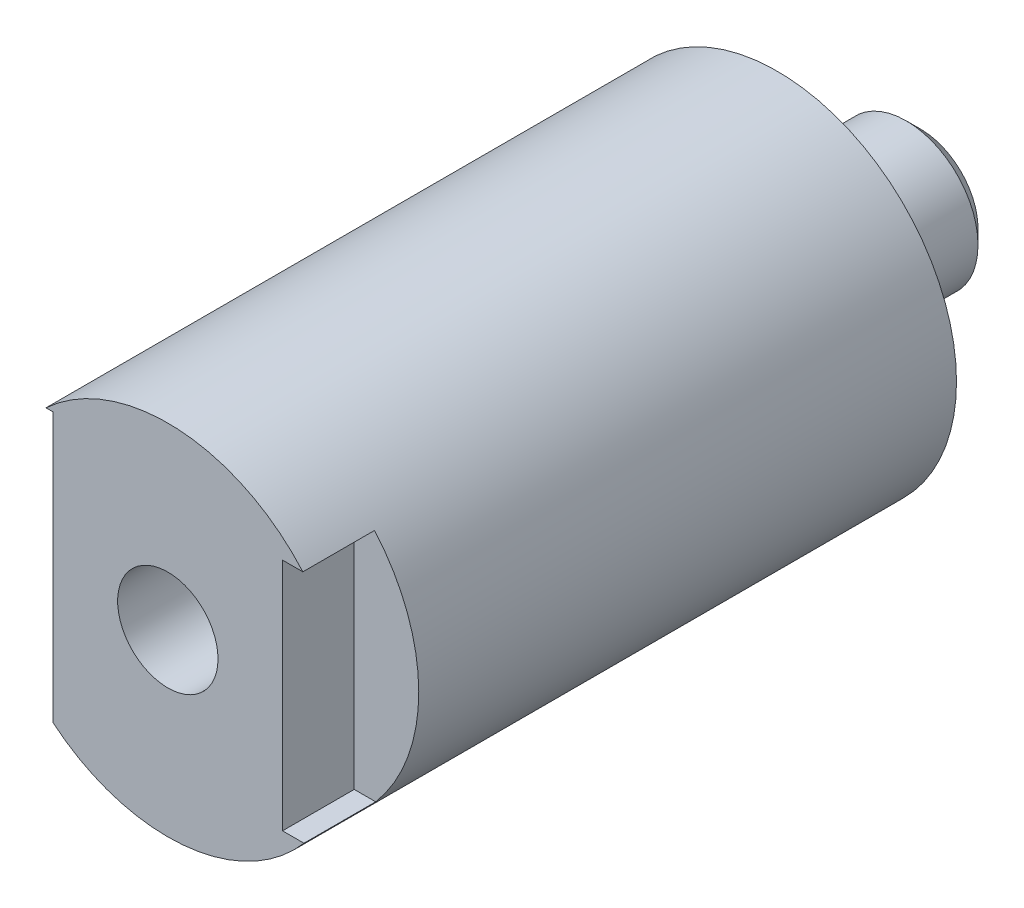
ISO-10303-21;
HEADER;
FILE_DESCRIPTION(('STEP AP214'),'2;1');
FILE_NAME('part.step','',(''),(''),'','','');
FILE_SCHEMA(('AUTOMOTIVE_DESIGN { 1 0 10303 214 1 1 1 1 }'));
ENDSEC;
DATA;
#1=APPLICATION_CONTEXT('core data for automotive mechanical design processes');
#2=APPLICATION_PROTOCOL_DEFINITION('international standard','automotive_design',2000,#1);
#3=PRODUCT_CONTEXT('',#1,'mechanical');
#4=PRODUCT('Part','Part','',(#3));
#5=PRODUCT_RELATED_PRODUCT_CATEGORY('part','',(#4));
#6=PRODUCT_DEFINITION_FORMATION('','',#4);
#7=PRODUCT_DEFINITION_CONTEXT('part definition',#1,'design');
#8=PRODUCT_DEFINITION('design','',#6,#7);
#9=PRODUCT_DEFINITION_SHAPE('','',#8);
#10=(LENGTH_UNIT() NAMED_UNIT(*) SI_UNIT(.MILLI.,.METRE.));
#11=(NAMED_UNIT(*) PLANE_ANGLE_UNIT() SI_UNIT($,.RADIAN.));
#12=(NAMED_UNIT(*) SI_UNIT($,.STERADIAN.) SOLID_ANGLE_UNIT());
#13=UNCERTAINTY_MEASURE_WITH_UNIT(LENGTH_MEASURE(1.E-05),#10,'distance_accuracy_value','');
#14=(GEOMETRIC_REPRESENTATION_CONTEXT(3) GLOBAL_UNCERTAINTY_ASSIGNED_CONTEXT((#13)) GLOBAL_UNIT_ASSIGNED_CONTEXT((#10,
#11,#12)) REPRESENTATION_CONTEXT('',''));
#15=CARTESIAN_POINT('',(0.,0.,0.));
#16=DIRECTION('',(0.,0.,1.));
#17=DIRECTION('',(1.,0.,0.));
#18=AXIS2_PLACEMENT_3D('',#15,#16,#17);
#19=CARTESIAN_POINT('',(0.,0.,0.));
#20=DIRECTION('',(0.,0.,1.));
#21=DIRECTION('',(1.,0.,0.));
#22=AXIS2_PLACEMENT_3D('',#19,#20,#21);
#23=PLANE('',#22);
#24=CARTESIAN_POINT('',(0.,0.,0.));
#25=DIRECTION('',(0.,0.,1.));
#26=DIRECTION('',(1.,0.,0.));
#27=AXIS2_PLACEMENT_3D('',#24,#25,#26);
#28=CIRCLE('',#27,25.);
#29=CARTESIAN_POINT('',(25.,0.,0.));
#30=VERTEX_POINT('',#29);
#31=EDGE_CURVE('E140',#30,#30,#28,.T.);
#32=ORIENTED_EDGE('',*,*,#31,.F.);
#33=EDGE_LOOP('',(#32));
#34=FACE_BOUND('',#33,.T.);
#35=CARTESIAN_POINT('',(0.,0.,0.));
#36=DIRECTION('',(0.,0.,1.));
#37=DIRECTION('',(1.,0.,0.));
#38=AXIS2_PLACEMENT_3D('',#35,#36,#37);
#39=CIRCLE('',#38,10.);
#40=CARTESIAN_POINT('',(10.,0.,0.));
#41=VERTEX_POINT('',#40);
#42=EDGE_CURVE('E155',#41,#41,#39,.F.);
#43=ORIENTED_EDGE('',*,*,#42,.F.);
#44=EDGE_LOOP('',(#43));
#45=FACE_BOUND('',#44,.T.);
#46=ADVANCED_FACE('F28',(#34,#45),#23,.F.);
#47=CARTESIAN_POINT('',(0.,0.,85.));
#48=DIRECTION('',(0.,0.,-1.));
#49=DIRECTION('',(-1.,0.,0.));
#50=AXIS2_PLACEMENT_3D('',#47,#48,#49);
#51=CYLINDRICAL_SURFACE('',#50,25.);
#52=CARTESIAN_POINT('',(0.,0.,75.));
#53=DIRECTION('',(0.,0.,1.));
#54=DIRECTION('',(1.,0.,0.));
#55=AXIS2_PLACEMENT_3D('',#52,#53,#54);
#56=CIRCLE('',#55,25.);
#57=CARTESIAN_POINT('',(-16.9918585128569,18.3378500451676,74.9999999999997));
#58=VERTEX_POINT('',#57);
#59=CARTESIAN_POINT('',(-16.,-19.2093727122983,74.9999999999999));
#60=VERTEX_POINT('',#59);
#61=EDGE_CURVE('E153',#58,#60,#56,.T.);
#62=ORIENTED_EDGE('',*,*,#61,.F.);
#63=DIRECTION('',(0.,0.,-1.));
#64=VECTOR('',#63,1.);
#65=CARTESIAN_POINT('',(-16.991858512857,18.3378500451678,84.9999999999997));
#66=LINE('',#65,#64);
#67=CARTESIAN_POINT('',(-16.991858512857,18.3378500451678,84.9999999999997));
#68=VERTEX_POINT('',#67);
#69=EDGE_CURVE('E115',#58,#68,#66,.F.);
#70=ORIENTED_EDGE('',*,*,#69,.T.);
#71=CARTESIAN_POINT('',(0.,0.,85.));
#72=DIRECTION('',(0.,0.,1.));
#73=DIRECTION('',(1.,0.,0.));
#74=AXIS2_PLACEMENT_3D('',#71,#72,#73);
#75=CIRCLE('',#74,25.);
#76=CARTESIAN_POINT('',(18.8334562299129,16.4408310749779,84.9999999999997));
#77=VERTEX_POINT('',#76);
#78=EDGE_CURVE('E144',#77,#68,#75,.T.);
#79=ORIENTED_EDGE('',*,*,#78,.F.);
#80=DIRECTION('',(0.,0.,-1.));
#81=VECTOR('',#80,1.);
#82=CARTESIAN_POINT('',(18.8334562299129,16.4408310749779,84.9999999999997));
#83=LINE('',#82,#81);
#84=CARTESIAN_POINT('',(18.8334562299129,16.4408310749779,74.9999999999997));
#85=VERTEX_POINT('',#84);
#86=EDGE_CURVE('E137',#77,#85,#83,.T.);
#87=ORIENTED_EDGE('',*,*,#86,.T.);
#88=CARTESIAN_POINT('',(0.,0.,75.));
#89=DIRECTION('',(0.,0.,1.));
#90=DIRECTION('',(1.,0.,0.));
#91=AXIS2_PLACEMENT_3D('',#88,#89,#90);
#92=CIRCLE('',#91,25.);
#93=CARTESIAN_POINT('',(18.9896580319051,-16.2601626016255,75.));
#94=VERTEX_POINT('',#93);
#95=EDGE_CURVE('E149',#94,#85,#92,.T.);
#96=ORIENTED_EDGE('',*,*,#95,.F.);
#97=DIRECTION('',(0.,0.,-1.));
#98=VECTOR('',#97,1.);
#99=CARTESIAN_POINT('',(18.9896580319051,-16.2601626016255,84.9999999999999));
#100=LINE('',#99,#98);
#101=CARTESIAN_POINT('',(18.9896580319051,-16.2601626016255,84.9999999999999));
#102=VERTEX_POINT('',#101);
#103=EDGE_CURVE('E133',#94,#102,#100,.F.);
#104=ORIENTED_EDGE('',*,*,#103,.T.);
#105=CARTESIAN_POINT('',(-16.,-19.2093727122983,84.9999999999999));
#106=VERTEX_POINT('',#105);
#107=EDGE_CURVE('E143',#106,#102,#75,.T.);
#108=ORIENTED_EDGE('',*,*,#107,.F.);
#109=DIRECTION('',(0.,0.,-1.));
#110=VECTOR('',#109,1.);
#111=CARTESIAN_POINT('',(-16.,-19.2093727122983,84.9999999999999));
#112=LINE('',#111,#110);
#113=EDGE_CURVE('E43',#106,#60,#112,.T.);
#114=ORIENTED_EDGE('',*,*,#113,.T.);
#115=EDGE_LOOP('',(#62,#70,#79,#87,#96,#104,#108,#114));
#116=FACE_BOUND('',#115,.T.);
#117=ORIENTED_EDGE('',*,*,#31,.T.);
#118=EDGE_LOOP('',(#117));
#119=FACE_BOUND('',#118,.T.);
#120=ADVANCED_FACE('F30',(#116,#119),#51,.T.);
#121=CARTESIAN_POINT('',(0.,0.,85.));
#122=DIRECTION('',(0.,0.,1.));
#123=DIRECTION('',(1.,0.,0.));
#124=AXIS2_PLACEMENT_3D('',#121,#122,#123);
#125=PLANE('',#124);
#126=CARTESIAN_POINT('',(0.,0.,85.));
#127=DIRECTION('',(0.,0.,1.));
#128=DIRECTION('',(1.,0.,0.));
#129=AXIS2_PLACEMENT_3D('',#126,#127,#128);
#130=CIRCLE('',#129,6.99999999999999);
#131=CARTESIAN_POINT('',(7.,0.,85.));
#132=VERTEX_POINT('',#131);
#133=EDGE_CURVE('E99',#132,#132,#130,.T.);
#134=ORIENTED_EDGE('',*,*,#133,.F.);
#135=EDGE_LOOP('',(#134));
#136=FACE_BOUND('',#135,.T.);
#137=DIRECTION('',(-1.,0.,0.));
#138=VECTOR('',#137,1.);
#139=CARTESIAN_POINT('',(-28.3757904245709,18.3378500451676,85.));
#140=LINE('',#139,#138);
#141=CARTESIAN_POINT('',(-16.,18.3378500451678,84.9999999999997));
#142=VERTEX_POINT('',#141);
#143=EDGE_CURVE('E102',#142,#68,#140,.T.);
#144=ORIENTED_EDGE('',*,*,#143,.F.);
#145=DIRECTION('',(0.,1.,0.));
#146=VECTOR('',#145,1.);
#147=CARTESIAN_POINT('',(-16.,2.4980018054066E-13,85.));
#148=LINE('',#147,#146);
#149=EDGE_CURVE('E151',#106,#142,#148,.T.);
#150=ORIENTED_EDGE('',*,*,#149,.F.);
#151=ORIENTED_EDGE('',*,*,#107,.T.);
#152=DIRECTION('',(1.,0.,0.));
#153=VECTOR('',#152,1.);
#154=CARTESIAN_POINT('',(16.,-16.2601626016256,85.));
#155=LINE('',#154,#153);
#156=CARTESIAN_POINT('',(16.,-16.2601626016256,85.));
#157=VERTEX_POINT('',#156);
#158=EDGE_CURVE('E119',#157,#102,#155,.T.);
#159=ORIENTED_EDGE('',*,*,#158,.F.);
#160=DIRECTION('',(0.,-1.,0.));
#161=VECTOR('',#160,1.);
#162=CARTESIAN_POINT('',(16.,16.4408310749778,85.));
#163=LINE('',#162,#161);
#164=CARTESIAN_POINT('',(16.,16.4408310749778,85.));
#165=VERTEX_POINT('',#164);
#166=EDGE_CURVE('E51',#165,#157,#163,.T.);
#167=ORIENTED_EDGE('',*,*,#166,.F.);
#168=DIRECTION('',(-1.,0.,0.));
#169=VECTOR('',#168,1.);
#170=CARTESIAN_POINT('',(1.38777878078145E-13,16.4408310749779,85.));
#171=LINE('',#170,#169);
#172=EDGE_CURVE('E147',#77,#165,#171,.T.);
#173=ORIENTED_EDGE('',*,*,#172,.F.);
#174=ORIENTED_EDGE('',*,*,#78,.T.);
#175=EDGE_LOOP('',(#144,#150,#151,#159,#167,#173,#174));
#176=FACE_BOUND('',#175,.T.);
#177=ADVANCED_FACE('F183',(#136,#176),#125,.T.);
#178=CARTESIAN_POINT('',(16.,-16.2601626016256,75.));
#179=DIRECTION('',(0.,0.,1.));
#180=DIRECTION('',(1.,0.,0.));
#181=AXIS2_PLACEMENT_3D('',#178,#179,#180);
#182=PLANE('',#181);
#183=ORIENTED_EDGE('',*,*,#95,.T.);
#184=DIRECTION('',(-1.,0.,0.));
#185=VECTOR('',#184,1.);
#186=CARTESIAN_POINT('',(16.,16.4408310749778,75.));
#187=LINE('',#186,#185);
#188=CARTESIAN_POINT('',(16.,16.4408310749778,75.));
#189=VERTEX_POINT('',#188);
#190=EDGE_CURVE('E128',#85,#189,#187,.T.);
#191=ORIENTED_EDGE('',*,*,#190,.T.);
#192=DIRECTION('',(0.,-1.,0.));
#193=VECTOR('',#192,1.);
#194=CARTESIAN_POINT('',(16.,16.4408310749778,75.));
#195=LINE('',#194,#193);
#196=CARTESIAN_POINT('',(16.,-16.2601626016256,75.));
#197=VERTEX_POINT('',#196);
#198=EDGE_CURVE('E122',#189,#197,#195,.T.);
#199=ORIENTED_EDGE('',*,*,#198,.T.);
#200=DIRECTION('',(1.,0.,0.));
#201=VECTOR('',#200,1.);
#202=CARTESIAN_POINT('',(16.,-16.2601626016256,75.));
#203=LINE('',#202,#201);
#204=EDGE_CURVE('E125',#197,#94,#203,.T.);
#205=ORIENTED_EDGE('',*,*,#204,.T.);
#206=EDGE_LOOP('',(#183,#191,#199,#205));
#207=FACE_BOUND('',#206,.T.);
#208=ADVANCED_FACE('F191',(#207),#182,.T.);
#209=CARTESIAN_POINT('',(16.,16.4408310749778,75.));
#210=DIRECTION('',(0.,1.,0.));
#211=DIRECTION('',(0.,0.,1.));
#212=AXIS2_PLACEMENT_3D('',#209,#210,#211);
#213=PLANE('',#212);
#214=ORIENTED_EDGE('',*,*,#172,.T.);
#215=DIRECTION('',(0.,0.,1.));
#216=VECTOR('',#215,1.);
#217=CARTESIAN_POINT('',(16.,16.4408310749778,75.));
#218=LINE('',#217,#216);
#219=EDGE_CURVE('E131',#189,#165,#218,.T.);
#220=ORIENTED_EDGE('',*,*,#219,.F.);
#221=ORIENTED_EDGE('',*,*,#190,.F.);
#222=ORIENTED_EDGE('',*,*,#86,.F.);
#223=EDGE_LOOP('',(#214,#220,#221,#222));
#224=FACE_BOUND('',#223,.T.);
#225=ADVANCED_FACE('F196',(#224),#213,.F.);
#226=CARTESIAN_POINT('',(16.,-16.2601626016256,75.));
#227=DIRECTION('',(0.,-1.,0.));
#228=DIRECTION('',(0.,0.,-1.));
#229=AXIS2_PLACEMENT_3D('',#226,#227,#228);
#230=PLANE('',#229);
#231=ORIENTED_EDGE('',*,*,#204,.F.);
#232=DIRECTION('',(0.,0.,1.));
#233=VECTOR('',#232,1.);
#234=CARTESIAN_POINT('',(16.,-16.2601626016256,75.));
#235=LINE('',#234,#233);
#236=EDGE_CURVE('E130',#197,#157,#235,.T.);
#237=ORIENTED_EDGE('',*,*,#236,.T.);
#238=ORIENTED_EDGE('',*,*,#158,.T.);
#239=ORIENTED_EDGE('',*,*,#103,.F.);
#240=EDGE_LOOP('',(#231,#237,#238,#239));
#241=FACE_BOUND('',#240,.T.);
#242=ADVANCED_FACE('F224',(#241),#230,.F.);
#243=CARTESIAN_POINT('',(16.,16.4408310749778,75.));
#244=DIRECTION('',(-1.,0.,0.));
#245=DIRECTION('',(0.,-1.,0.));
#246=AXIS2_PLACEMENT_3D('',#243,#244,#245);
#247=PLANE('',#246);
#248=ORIENTED_EDGE('',*,*,#166,.T.);
#249=ORIENTED_EDGE('',*,*,#236,.F.);
#250=ORIENTED_EDGE('',*,*,#198,.F.);
#251=ORIENTED_EDGE('',*,*,#219,.T.);
#252=EDGE_LOOP('',(#248,#249,#250,#251));
#253=FACE_BOUND('',#252,.T.);
#254=ADVANCED_FACE('F188',(#253),#247,.F.);
#255=CARTESIAN_POINT('',(-28.3757904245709,-19.2411924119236,75.));
#256=DIRECTION('',(0.,0.,1.));
#257=DIRECTION('',(1.,0.,0.));
#258=AXIS2_PLACEMENT_3D('',#255,#256,#257);
#259=PLANE('',#258);
#260=ORIENTED_EDGE('',*,*,#61,.T.);
#261=DIRECTION('',(0.,1.,0.));
#262=VECTOR('',#261,1.);
#263=CARTESIAN_POINT('',(-16.,18.3378500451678,74.9999999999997));
#264=LINE('',#263,#262);
#265=CARTESIAN_POINT('',(-16.,18.3378500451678,74.9999999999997));
#266=VERTEX_POINT('',#265);
#267=EDGE_CURVE('E106',#60,#266,#264,.T.);
#268=ORIENTED_EDGE('',*,*,#267,.T.);
#269=DIRECTION('',(-1.,0.,0.));
#270=VECTOR('',#269,1.);
#271=CARTESIAN_POINT('',(-28.3757904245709,18.3378500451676,75.));
#272=LINE('',#271,#270);
#273=EDGE_CURVE('E108',#266,#58,#272,.T.);
#274=ORIENTED_EDGE('',*,*,#273,.T.);
#275=EDGE_LOOP('',(#260,#268,#274));
#276=FACE_BOUND('',#275,.T.);
#277=ADVANCED_FACE('F212',(#276),#259,.T.);
#278=CARTESIAN_POINT('',(-28.3757904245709,18.3378500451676,75.));
#279=DIRECTION('',(0.,1.,0.));
#280=DIRECTION('',(0.,0.,1.));
#281=AXIS2_PLACEMENT_3D('',#278,#279,#280);
#282=PLANE('',#281);
#283=ORIENTED_EDGE('',*,*,#273,.F.);
#284=DIRECTION('',(0.,0.,1.));
#285=VECTOR('',#284,1.);
#286=CARTESIAN_POINT('',(-16.,18.3378500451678,74.9999999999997));
#287=LINE('',#286,#285);
#288=EDGE_CURVE('E111',#266,#142,#287,.T.);
#289=ORIENTED_EDGE('',*,*,#288,.T.);
#290=ORIENTED_EDGE('',*,*,#143,.T.);
#291=ORIENTED_EDGE('',*,*,#69,.F.);
#292=EDGE_LOOP('',(#283,#289,#290,#291));
#293=FACE_BOUND('',#292,.T.);
#294=ADVANCED_FACE('F207',(#293),#282,.F.);
#295=CARTESIAN_POINT('',(-16.,18.3378500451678,74.9999999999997));
#296=DIRECTION('',(1.,0.,0.));
#297=DIRECTION('',(0.,1.,0.));
#298=AXIS2_PLACEMENT_3D('',#295,#296,#297);
#299=PLANE('',#298);
#300=ORIENTED_EDGE('',*,*,#149,.T.);
#301=ORIENTED_EDGE('',*,*,#288,.F.);
#302=ORIENTED_EDGE('',*,*,#267,.F.);
#303=ORIENTED_EDGE('',*,*,#113,.F.);
#304=EDGE_LOOP('',(#300,#301,#302,#303));
#305=FACE_BOUND('',#304,.T.);
#306=ADVANCED_FACE('F213',(#305),#299,.F.);
#307=CARTESIAN_POINT('',(2.81025203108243E-13,2.77555756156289E-13,-20.0000000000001));
#308=DIRECTION('',(0.,0.,1.));
#309=DIRECTION('',(1.,0.,0.));
#310=AXIS2_PLACEMENT_3D('',#307,#308,#309);
#311=CYLINDRICAL_SURFACE('',#310,10.);
#312=CARTESIAN_POINT('',(2.81025203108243E-13,0.,-18.));
#313=DIRECTION('',(0.,0.,-1.));
#314=DIRECTION('',(-1.,0.,0.));
#315=AXIS2_PLACEMENT_3D('',#312,#313,#314);
#316=CIRCLE('',#315,10.);
#317=CARTESIAN_POINT('',(-9.99999999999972,0.,-18.));
#318=VERTEX_POINT('',#317);
#319=EDGE_CURVE('E11',#318,#318,#316,.F.);
#320=ORIENTED_EDGE('',*,*,#319,.T.);
#321=EDGE_LOOP('',(#320));
#322=FACE_BOUND('',#321,.T.);
#323=ORIENTED_EDGE('',*,*,#42,.T.);
#324=EDGE_LOOP('',(#323));
#325=FACE_BOUND('',#324,.T.);
#326=ADVANCED_FACE('F172',(#322,#325),#311,.T.);
#327=CARTESIAN_POINT('',(2.81025203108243E-13,2.77555756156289E-13,-20.0000000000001));
#328=DIRECTION('',(0.,0.,-1.));
#329=DIRECTION('',(-1.,0.,0.));
#330=AXIS2_PLACEMENT_3D('',#327,#328,#329);
#331=PLANE('',#330);
#332=CARTESIAN_POINT('',(2.81025203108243E-13,2.77555756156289E-13,-20.0000000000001));
#333=DIRECTION('',(0.,0.,-1.));
#334=DIRECTION('',(-1.,0.,0.));
#335=AXIS2_PLACEMENT_3D('',#332,#333,#334);
#336=CIRCLE('',#335,8.);
#337=CARTESIAN_POINT('',(-7.99999999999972,2.77555756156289E-13,-20.0000000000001));
#338=VERTEX_POINT('',#337);
#339=EDGE_CURVE('E36',#338,#338,#336,.T.);
#340=ORIENTED_EDGE('',*,*,#339,.T.);
#341=EDGE_LOOP('',(#340));
#342=FACE_BOUND('',#341,.T.);
#343=ADVANCED_FACE('F160',(#342),#331,.T.);
#344=CARTESIAN_POINT('',(2.81025203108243E-13,2.77555756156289E-13,-20.0000000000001));
#345=DIRECTION('',(0.,0.,1.));
#346=DIRECTION('',(1.,0.,0.));
#347=AXIS2_PLACEMENT_3D('',#344,#345,#346);
#348=CONICAL_SURFACE('',#347,8.,0.785398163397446);
#349=ORIENTED_EDGE('',*,*,#319,.F.);
#350=EDGE_LOOP('',(#349));
#351=FACE_BOUND('',#350,.T.);
#352=ORIENTED_EDGE('',*,*,#339,.F.);
#353=EDGE_LOOP('',(#352));
#354=FACE_BOUND('',#353,.T.);
#355=ADVANCED_FACE('F162',(#351,#354),#348,.T.);
#356=CARTESIAN_POINT('',(0.,0.,85.));
#357=DIRECTION('',(0.,0.,1.));
#358=DIRECTION('',(1.,0.,0.));
#359=AXIS2_PLACEMENT_3D('',#356,#357,#358);
#360=CYLINDRICAL_SURFACE('',#359,6.99999999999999);
#361=CARTESIAN_POINT('',(0.,2.77555756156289E-13,55.));
#362=DIRECTION('',(0.,0.,1.));
#363=DIRECTION('',(1.,0.,0.));
#364=AXIS2_PLACEMENT_3D('',#361,#362,#363);
#365=CIRCLE('',#364,6.99999999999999);
#366=CARTESIAN_POINT('',(6.99999999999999,2.77555756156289E-13,55.));
#367=VERTEX_POINT('',#366);
#368=EDGE_CURVE('E97',#367,#367,#365,.T.);
#369=ORIENTED_EDGE('',*,*,#368,.F.);
#370=EDGE_LOOP('',(#369));
#371=FACE_BOUND('',#370,.T.);
#372=ORIENTED_EDGE('',*,*,#133,.T.);
#373=EDGE_LOOP('',(#372));
#374=FACE_BOUND('',#373,.T.);
#375=ADVANCED_FACE('F93',(#371,#374),#360,.F.);
#376=CARTESIAN_POINT('',(0.,2.77555756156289E-13,55.));
#377=DIRECTION('',(0.,0.,1.));
#378=DIRECTION('',(1.,0.,0.));
#379=AXIS2_PLACEMENT_3D('',#376,#377,#378);
#380=CONICAL_SURFACE('',#379,6.99999999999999,1.02974425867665);
#381=CARTESIAN_POINT('',(1.42247325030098E-13,2.77555756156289E-13,50.7939756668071));
#382=VERTEX_POINT('',#381);
#383=VERTEX_LOOP('',#382);
#384=FACE_BOUND('',#383,.T.);
#385=ORIENTED_EDGE('',*,*,#368,.T.);
#386=EDGE_LOOP('',(#385));
#387=FACE_BOUND('',#386,.T.);
#388=ADVANCED_FACE('F90',(#384,#387),#380,.F.);
#389=CLOSED_SHELL('',(#46,#120,#177,#208,#225,#242,#254,#277,#294,#306,#326,#343,#355,#375,#388));
#390=MANIFOLD_SOLID_BREP('B2',#389);
#391=ADVANCED_BREP_SHAPE_REPRESENTATION('',(#18,#390),#14);
#392=SHAPE_DEFINITION_REPRESENTATION(#9,#391);
ENDSEC;
END-ISO-10303-21;
